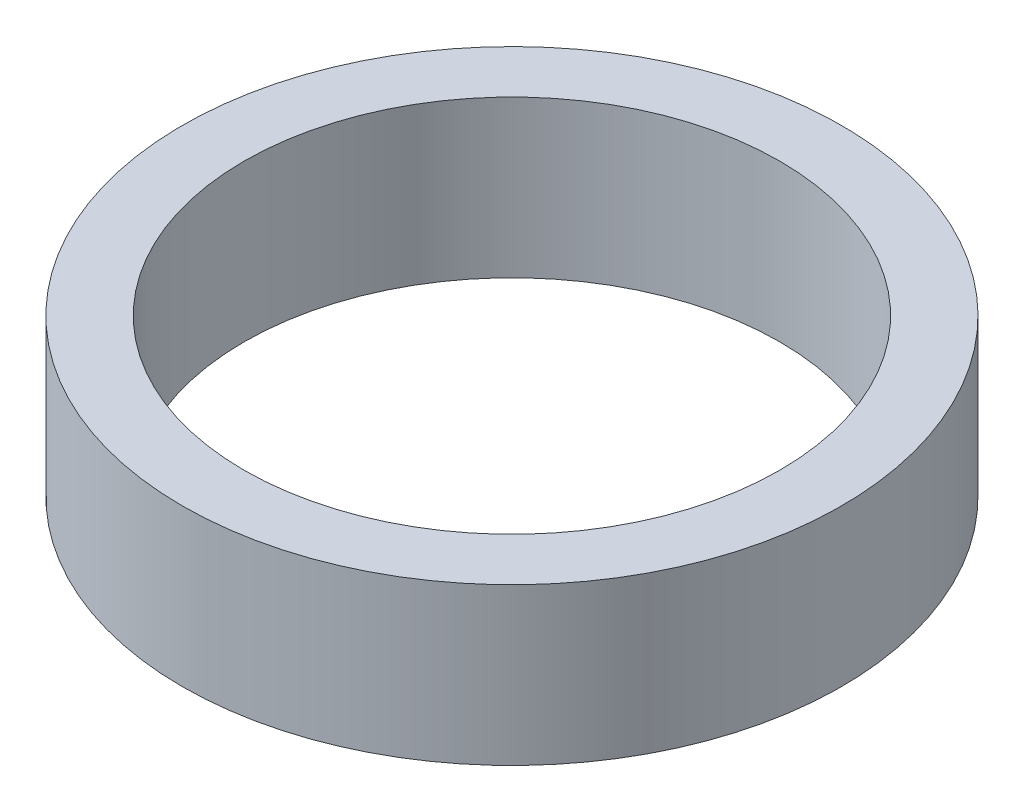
from build123d import *

# Parameters (mm, degrees)
CROQUIS1_R              = 40
SALIENTE_EXTRUIR1_DEPTH = 19
CROQUIS2_R              = 32.5
CORTAR_EXTRUIR1_DEPTH   = 19


with BuildPart() as part:
    # Croquis1 → Saliente-Extruir1 (new body)
    with BuildSketch(Plane(origin=(0, 0, 0), x_dir=(1, 0, 0), z_dir=(0, 1, 0))):
        with Locations(Location((0, 0, 0), (0, 0, 270))):
            Circle(CROQUIS1_R)
    extrude(amount=SALIENTE_EXTRUIR1_DEPTH)

    # Croquis2 → Cortar-Extruir1 (cut)
    with BuildSketch(Plane(origin=(0, 19, 0), x_dir=(1, 0, 0), z_dir=(0, 1, 0))):
        with Locations(Location((0, 0, 0), (0, 0, 270))):
            Circle(CROQUIS2_R)
    extrude(amount=-CORTAR_EXTRUIR1_DEPTH, mode=Mode.SUBTRACT)


solid = part.part
